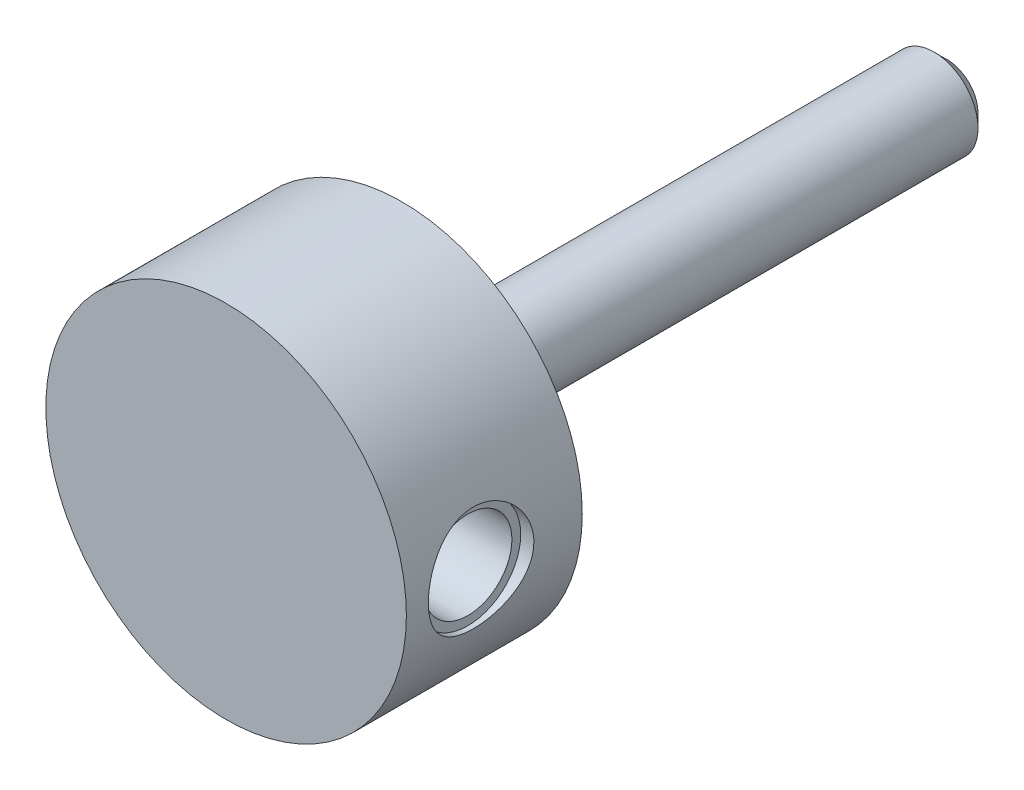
ISO-10303-21;
HEADER;
FILE_DESCRIPTION(('STEP AP214'),'2;1');
FILE_NAME('part.step','',(''),(''),'','','');
FILE_SCHEMA(('AUTOMOTIVE_DESIGN { 1 0 10303 214 1 1 1 1 }'));
ENDSEC;
DATA;
#1=APPLICATION_CONTEXT('core data for automotive mechanical design processes');
#2=APPLICATION_PROTOCOL_DEFINITION('international standard','automotive_design',2000,#1);
#3=PRODUCT_CONTEXT('',#1,'mechanical');
#4=PRODUCT('Part','Part','',(#3));
#5=PRODUCT_RELATED_PRODUCT_CATEGORY('part','',(#4));
#6=PRODUCT_DEFINITION_FORMATION('','',#4);
#7=PRODUCT_DEFINITION_CONTEXT('part definition',#1,'design');
#8=PRODUCT_DEFINITION('design','',#6,#7);
#9=PRODUCT_DEFINITION_SHAPE('','',#8);
#10=(LENGTH_UNIT() NAMED_UNIT(*) SI_UNIT(.MILLI.,.METRE.));
#11=(NAMED_UNIT(*) PLANE_ANGLE_UNIT() SI_UNIT($,.RADIAN.));
#12=(NAMED_UNIT(*) SI_UNIT($,.STERADIAN.) SOLID_ANGLE_UNIT());
#13=UNCERTAINTY_MEASURE_WITH_UNIT(LENGTH_MEASURE(1.E-05),#10,'distance_accuracy_value','');
#14=(GEOMETRIC_REPRESENTATION_CONTEXT(3) GLOBAL_UNCERTAINTY_ASSIGNED_CONTEXT((#13)) GLOBAL_UNIT_ASSIGNED_CONTEXT((#10,
#11,#12)) REPRESENTATION_CONTEXT('',''));
#15=CARTESIAN_POINT('',(0.,0.,0.));
#16=DIRECTION('',(0.,0.,1.));
#17=DIRECTION('',(1.,0.,0.));
#18=AXIS2_PLACEMENT_3D('',#15,#16,#17);
#19=CARTESIAN_POINT('',(0.,0.,0.));
#20=DIRECTION('',(0.,0.,1.));
#21=DIRECTION('',(1.,0.,0.));
#22=AXIS2_PLACEMENT_3D('',#19,#20,#21);
#23=PLANE('',#22);
#24=CARTESIAN_POINT('',(0.,0.,0.));
#25=DIRECTION('',(0.,0.,1.));
#26=DIRECTION('',(1.,0.,0.));
#27=AXIS2_PLACEMENT_3D('',#24,#25,#26);
#28=CIRCLE('',#27,9.5);
#29=CARTESIAN_POINT('',(9.5,0.,0.));
#30=VERTEX_POINT('',#29);
#31=EDGE_CURVE('E27',#30,#30,#28,.T.);
#32=ORIENTED_EDGE('',*,*,#31,.F.);
#33=EDGE_LOOP('',(#32));
#34=FACE_BOUND('',#33,.T.);
#35=CARTESIAN_POINT('',(0.,0.,0.));
#36=DIRECTION('',(0.,0.,1.));
#37=DIRECTION('',(1.,0.,0.));
#38=AXIS2_PLACEMENT_3D('',#35,#36,#37);
#39=CIRCLE('',#38,5.);
#40=CARTESIAN_POINT('',(5.,0.,0.));
#41=VERTEX_POINT('',#40);
#42=EDGE_CURVE('E23',#41,#41,#39,.F.);
#43=ORIENTED_EDGE('',*,*,#42,.F.);
#44=EDGE_LOOP('',(#43));
#45=FACE_BOUND('',#44,.T.);
#46=ADVANCED_FACE('F12',(#34,#45),#23,.F.);
#47=CARTESIAN_POINT('',(0.,0.,40.));
#48=DIRECTION('',(0.,0.,1.));
#49=DIRECTION('',(1.,0.,0.));
#50=AXIS2_PLACEMENT_3D('',#47,#48,#49);
#51=CYLINDRICAL_SURFACE('',#50,9.5);
#52=CARTESIAN_POINT('',(0.,0.,2.));
#53=DIRECTION('',(0.,0.,1.));
#54=DIRECTION('',(1.,0.,0.));
#55=AXIS2_PLACEMENT_3D('',#52,#53,#54);
#56=CIRCLE('',#55,9.5);
#57=CARTESIAN_POINT('',(9.5,0.,2.));
#58=VERTEX_POINT('',#57);
#59=EDGE_CURVE('E38',#58,#58,#56,.T.);
#60=ORIENTED_EDGE('',*,*,#59,.F.);
#61=EDGE_LOOP('',(#60));
#62=FACE_BOUND('',#61,.T.);
#63=ORIENTED_EDGE('',*,*,#31,.T.);
#64=EDGE_LOOP('',(#63));
#65=FACE_BOUND('',#64,.T.);
#66=ADVANCED_FACE('F65',(#62,#65),#51,.T.);
#67=CARTESIAN_POINT('',(20.5,0.,22.));
#68=DIRECTION('',(0.,0.,-1.));
#69=DIRECTION('',(-1.,0.,0.));
#70=AXIS2_PLACEMENT_3D('',#67,#68,#69);
#71=PLANE('',#70);
#72=CARTESIAN_POINT('',(0.,0.,22.));
#73=DIRECTION('',(0.,0.,1.));
#74=DIRECTION('',(1.,0.,0.));
#75=AXIS2_PLACEMENT_3D('',#72,#73,#74);
#76=CIRCLE('',#75,20.5);
#77=CARTESIAN_POINT('',(20.5,0.,22.));
#78=VERTEX_POINT('',#77);
#79=EDGE_CURVE('E82',#78,#78,#76,.T.);
#80=ORIENTED_EDGE('',*,*,#79,.T.);
#81=EDGE_LOOP('',(#80));
#82=FACE_BOUND('',#81,.T.);
#83=ADVANCED_FACE('F60',(#82),#71,.F.);
#84=CARTESIAN_POINT('',(0.,0.,40.));
#85=DIRECTION('',(0.,0.,1.));
#86=DIRECTION('',(1.,0.,0.));
#87=AXIS2_PLACEMENT_3D('',#84,#85,#86);
#88=CYLINDRICAL_SURFACE('',#87,20.5);
#89=CARTESIAN_POINT('',(20.5,0.,7.5));
#90=CARTESIAN_POINT('',(20.4999997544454,-0.164768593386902,7.50000038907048));
#91=CARTESIAN_POINT('',(20.4980087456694,-0.329544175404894,7.50679278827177));
#92=CARTESIAN_POINT('',(20.4900990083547,-0.65788822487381,7.5339021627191));
#93=CARTESIAN_POINT('',(20.4841800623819,-0.821456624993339,7.55421988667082));
#94=CARTESIAN_POINT('',(20.4685766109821,-1.1462122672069,7.60820100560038));
#95=CARTESIAN_POINT('',(20.4588916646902,-1.30739922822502,7.64186596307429));
#96=CARTESIAN_POINT('',(20.4360164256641,-1.62628314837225,7.72226244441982));
#97=CARTESIAN_POINT('',(20.4228249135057,-1.7839788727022,7.76899851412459));
#98=CARTESIAN_POINT('',(20.3933182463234,-2.09448185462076,7.87505403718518));
#99=CARTESIAN_POINT('',(20.3770082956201,-2.24729676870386,7.93435254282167));
#100=CARTESIAN_POINT('',(20.3416823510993,-2.54730770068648,8.06511256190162));
#101=CARTESIAN_POINT('',(20.3226662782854,-2.69450355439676,8.13657443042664));
#102=CARTESIAN_POINT('',(20.2824208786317,-2.98237032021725,8.2911456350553));
#103=CARTESIAN_POINT('',(20.2611910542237,-3.123039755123,8.37425759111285));
#104=CARTESIAN_POINT('',(20.2170775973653,-3.39691169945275,8.55150630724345));
#105=CARTESIAN_POINT('',(20.1941944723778,-3.53011647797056,8.6456396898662));
#106=CARTESIAN_POINT('',(20.146767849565,-3.79154794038,8.84682399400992));
#107=CARTESIAN_POINT('',(20.1221971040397,-3.91956600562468,8.95413966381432));
#108=CARTESIAN_POINT('',(20.0725990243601,-4.1661228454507,9.17897611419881));
#109=CARTESIAN_POINT('',(20.0475718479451,-4.2846648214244,9.29649342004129));
#110=CARTESIAN_POINT('',(19.9977175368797,-4.5116297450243,9.54108035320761));
#111=CARTESIAN_POINT('',(19.9728905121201,-4.62004743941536,9.66815487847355));
#112=CARTESIAN_POINT('',(19.9241410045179,-4.82595045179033,9.93095842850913));
#113=CARTESIAN_POINT('',(19.9002181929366,-4.92343976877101,10.0666842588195));
#114=CARTESIAN_POINT('',(19.8534354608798,-5.10885934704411,10.3490171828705));
#115=CARTESIAN_POINT('',(19.8306098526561,-5.19653638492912,10.4957964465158));
#116=CARTESIAN_POINT('',(19.7872868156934,-5.35913808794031,10.7965125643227));
#117=CARTESIAN_POINT('',(19.766788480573,-5.43406772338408,10.9504465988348));
#118=CARTESIAN_POINT('',(19.7287391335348,-5.57062666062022,11.2645036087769));
#119=CARTESIAN_POINT('',(19.7111887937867,-5.63225293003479,11.4246279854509));
#120=CARTESIAN_POINT('',(19.6796082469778,-5.74162541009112,11.7498143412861));
#121=CARTESIAN_POINT('',(19.6655765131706,-5.78937764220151,11.9148741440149));
#122=CARTESIAN_POINT('',(19.6418018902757,-5.86952471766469,12.2443484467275));
#123=CARTESIAN_POINT('',(19.6319555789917,-5.90229162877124,12.4086649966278));
#124=CARTESIAN_POINT('',(19.6163432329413,-5.95397424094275,12.7395899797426));
#125=CARTESIAN_POINT('',(19.6105755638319,-5.97289549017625,12.9061974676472));
#126=CARTESIAN_POINT('',(19.603301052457,-5.99672775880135,13.2405034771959));
#127=CARTESIAN_POINT('',(19.6017941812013,-6.00163887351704,13.4082019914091));
#128=CARTESIAN_POINT('',(19.6030905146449,-5.99740342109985,13.7434027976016));
#129=CARTESIAN_POINT('',(19.6058936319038,-5.98825713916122,13.9109050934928));
#130=CARTESIAN_POINT('',(19.6155486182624,-5.95655212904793,14.238688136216));
#131=CARTESIAN_POINT('',(19.6222578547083,-5.9344657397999,14.3990190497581));
#132=CARTESIAN_POINT('',(19.6394095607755,-5.87745500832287,14.7172343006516));
#133=CARTESIAN_POINT('',(19.649853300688,-5.84252629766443,14.8751177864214));
#134=CARTESIAN_POINT('',(19.6741615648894,-5.7601395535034,15.187257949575));
#135=CARTESIAN_POINT('',(19.688025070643,-5.71268525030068,15.3415156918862));
#136=CARTESIAN_POINT('',(19.7187796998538,-5.60560692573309,15.6454959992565));
#137=CARTESIAN_POINT('',(19.7356719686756,-5.5459782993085,15.7952168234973));
#138=CARTESIAN_POINT('',(19.7722410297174,-5.41416819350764,16.0910079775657));
#139=CARTESIAN_POINT('',(19.7919506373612,-5.34183608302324,16.2370072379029));
#140=CARTESIAN_POINT('',(19.8334359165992,-5.18568691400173,16.5224423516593));
#141=CARTESIAN_POINT('',(19.8552123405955,-5.10186566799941,16.6618757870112));
#142=CARTESIAN_POINT('',(19.9227548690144,-4.8340177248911,17.0689782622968));
#143=CARTESIAN_POINT('',(19.9707648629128,-4.63350124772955,17.3256854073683));
#144=CARTESIAN_POINT('',(20.0696162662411,-4.18511260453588,17.8126329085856));
#145=CARTESIAN_POINT('',(20.1204944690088,-3.93567819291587,18.0414205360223));
#146=CARTESIAN_POINT('',(20.2176813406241,-3.40132203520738,18.4542852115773));
#147=CARTESIAN_POINT('',(20.2639897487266,-3.11639826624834,18.63835970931));
#148=CARTESIAN_POINT('',(20.3472018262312,-2.51664006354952,18.9573414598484));
#149=CARTESIAN_POINT('',(20.3840462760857,-2.2016334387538,19.0919412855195));
#150=CARTESIAN_POINT('',(20.4437541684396,-1.55212614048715,19.3058343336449));
#151=CARTESIAN_POINT('',(20.4666213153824,-1.21763065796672,19.3851422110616));
#152=CARTESIAN_POINT('',(20.4952175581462,-0.550953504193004,19.4838192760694));
#153=CARTESIAN_POINT('',(20.5015074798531,-0.219085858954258,19.5051506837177));
#154=CARTESIAN_POINT('',(20.4978783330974,0.44350281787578,19.4927506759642));
#155=CARTESIAN_POINT('',(20.4879613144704,0.774223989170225,19.4590262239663));
#156=CARTESIAN_POINT('',(20.4533992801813,1.41781519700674,19.3390673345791));
#157=CARTESIAN_POINT('',(20.4290727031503,1.73091547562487,19.253967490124));
#158=CARTESIAN_POINT('',(20.3684901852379,2.33834273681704,19.0350155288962));
#159=CARTESIAN_POINT('',(20.3322328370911,2.63266749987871,18.901157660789));
#160=CARTESIAN_POINT('',(20.2505580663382,3.201467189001,18.585163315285));
#161=CARTESIAN_POINT('',(20.2049537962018,3.47535043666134,18.4020133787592));
#162=CARTESIAN_POINT('',(20.1098009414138,3.98926947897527,17.9937010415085));
#163=CARTESIAN_POINT('',(20.0602514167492,4.22929716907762,17.7685286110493));
#164=CARTESIAN_POINT('',(19.9860369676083,4.56311282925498,17.3996018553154));
#165=CARTESIAN_POINT('',(19.9608943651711,4.67160496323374,17.2689475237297));
#166=CARTESIAN_POINT('',(19.9116554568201,4.87720494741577,16.9988051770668));
#167=CARTESIAN_POINT('',(19.8875587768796,4.97431688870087,16.8593203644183));
#168=CARTESIAN_POINT('',(19.8411019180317,5.15650338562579,16.5723575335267));
#169=CARTESIAN_POINT('',(19.8187424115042,5.24157329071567,16.4248764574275));
#170=CARTESIAN_POINT('',(19.7764458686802,5.39896546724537,16.1230001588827));
#171=CARTESIAN_POINT('',(19.7565078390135,5.47129297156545,15.9686078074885));
#172=CARTESIAN_POINT('',(19.7197444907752,5.60234699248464,15.6546484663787));
#173=CARTESIAN_POINT('',(19.7029051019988,5.6611353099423,15.49510893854));
#174=CARTESIAN_POINT('',(19.6727610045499,5.76501533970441,15.1713718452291));
#175=CARTESIAN_POINT('',(19.6594548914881,5.81011249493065,15.0071761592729));
#176=CARTESIAN_POINT('',(19.6367999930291,5.88622676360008,14.675294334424));
#177=CARTESIAN_POINT('',(19.6274509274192,5.91724487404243,14.5076084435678));
#178=CARTESIAN_POINT('',(19.6130187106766,5.96490739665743,14.1700260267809));
#179=CARTESIAN_POINT('',(19.6079354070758,5.98155232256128,14.0001295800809));
#180=CARTESIAN_POINT('',(19.6023186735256,5.9999323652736,13.6662567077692));
#181=CARTESIAN_POINT('',(19.6016119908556,6.00223524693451,13.5023141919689));
#182=CARTESIAN_POINT('',(19.6043094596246,5.99341910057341,13.1747666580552));
#183=CARTESIAN_POINT('',(19.6077150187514,5.98229547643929,13.0111617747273));
#184=CARTESIAN_POINT('',(19.6185313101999,5.94672790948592,12.6856110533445));
#185=CARTESIAN_POINT('',(19.6259403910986,5.92228945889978,12.5236645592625));
#186=CARTESIAN_POINT('',(19.6445384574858,5.86030325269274,12.2024601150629));
#187=CARTESIAN_POINT('',(19.6557288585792,5.82275058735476,12.0432031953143));
#188=CARTESIAN_POINT('',(19.6814005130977,5.73537439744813,11.7303823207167));
#189=CARTESIAN_POINT('',(19.6958418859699,5.68569901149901,11.5767736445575));
#190=CARTESIAN_POINT('',(19.7276768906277,5.57423736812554,11.2742707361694));
#191=CARTESIAN_POINT('',(19.7450715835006,5.51244675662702,11.125378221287));
#192=CARTESIAN_POINT('',(19.782319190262,5.37724463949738,10.8333301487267));
#193=CARTESIAN_POINT('',(19.802171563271,5.30383568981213,10.6901733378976));
#194=CARTESIAN_POINT('',(19.8438063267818,5.14587421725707,10.4103722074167));
#195=CARTESIAN_POINT('',(19.8655894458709,5.061317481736,10.2737303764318));
#196=CARTESIAN_POINT('',(19.9112797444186,4.87853600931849,10.0032239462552));
#197=CARTESIAN_POINT('',(19.9352342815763,4.77994030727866,9.86961789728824));
#198=CARTESIAN_POINT('',(19.9839347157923,4.57206196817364,9.61107007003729));
#199=CARTESIAN_POINT('',(20.0086809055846,4.46277534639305,9.48613155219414));
#200=CARTESIAN_POINT('',(20.0582834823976,4.23425660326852,9.24575891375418));
#201=CARTESIAN_POINT('',(20.0831398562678,4.11502564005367,9.13032368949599));
#202=CARTESIAN_POINT('',(20.1323098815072,3.86730499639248,8.90963180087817));
#203=CARTESIAN_POINT('',(20.1566233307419,3.7388119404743,8.80437888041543));
#204=CARTESIAN_POINT('',(20.2046974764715,3.46977987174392,8.6020699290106));
#205=CARTESIAN_POINT('',(20.2284250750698,3.32900807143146,8.50531528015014));
#206=CARTESIAN_POINT('',(20.2739466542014,3.03949915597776,8.32403500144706));
#207=CARTESIAN_POINT('',(20.2957406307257,2.8907620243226,8.23950939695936));
#208=CARTESIAN_POINT('',(20.3367679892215,2.58639447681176,8.0833769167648));
#209=CARTESIAN_POINT('',(20.356002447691,2.43076699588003,8.01176460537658));
#210=CARTESIAN_POINT('',(20.3913677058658,2.11366097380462,7.88201306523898));
#211=CARTESIAN_POINT('',(20.4074988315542,1.95218304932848,7.82387242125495));
#212=CARTESIAN_POINT('',(20.4344672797,1.64423058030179,7.72771145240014));
#213=CARTESIAN_POINT('',(20.4457076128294,1.49828162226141,7.68811373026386));
#214=CARTESIAN_POINT('',(20.4651675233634,1.2036242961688,7.62002138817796));
#215=CARTESIAN_POINT('',(20.4733873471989,1.0549161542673,7.59152586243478));
#216=CARTESIAN_POINT('',(20.4866168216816,0.755624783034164,7.54584620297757));
#217=CARTESIAN_POINT('',(20.491626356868,0.605041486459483,7.52866247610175));
#218=CARTESIAN_POINT('',(20.49831762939,0.302973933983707,7.50574067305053));
#219=CARTESIAN_POINT('',(20.5000002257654,0.151489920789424,7.49999964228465));
#220=CARTESIAN_POINT('',(20.5,0.,7.5));
#221=B_SPLINE_CURVE_WITH_KNOTS('',3,(#89,#90,#91,#92,#93,#94,#95,#96,#97,#98,#99,#100,#101,#102,
#103,#104,#105,#106,#107,#108,#109,#110,#111,#112,#113,#114,#115,#116,#117,#118,#119,#120,#121,
#122,#123,#124,#125,#126,#127,#128,#129,#130,#131,#132,#133,#134,#135,#136,#137,#138,#139,#140,
#141,#142,#143,#144,#145,#146,#147,#148,#149,#150,#151,#152,#153,#154,#155,#156,#157,#158,#159,
#160,#161,#162,#163,#164,#165,#166,#167,#168,#169,#170,#171,#172,#173,#174,#175,#176,#177,#178,
#179,#180,#181,#182,#183,#184,#185,#186,#187,#188,#189,#190,#191,#192,#193,#194,#195,#196,#197,
#198,#199,#200,#201,#202,#203,#204,#205,#206,#207,#208,#209,#210,#211,#212,#213,#214,#215,#216,
#217,#218,#219,#220),.UNSPECIFIED.,.T.,.F.,(4,2,2,2,2,2,2,2,2,2,2,2,2,2,2,2,2,2,2,2,2,2,2,2,2,2,
2,2,2,2,2,2,2,2,2,2,2,2,2,2,2,2,2,2,2,2,2,2,2,2,2,2,2,2,2,2,2,2,2,2,2,2,2,2,2,4),(0.,
0.494166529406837,0.988360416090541,1.48261217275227,1.97703603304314,2.47064184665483,
2.96426207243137,3.45799348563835,3.95157399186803,4.45753270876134,4.96331976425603,
5.46936781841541,5.97523008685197,6.49206535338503,7.00869863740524,7.52544955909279,
8.04197586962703,8.54486934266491,9.04756118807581,9.55024961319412,10.0529278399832,
10.5383093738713,11.0238561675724,11.5092585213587,11.9948448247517,12.4866344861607,
12.9786038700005,13.9617709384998,14.9839152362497,16.006117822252,17.0345689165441,
18.062747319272,19.0556662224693,20.0484595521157,21.0200911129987,21.9918373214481,
22.9853318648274,23.97906383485,24.4935931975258,25.0079370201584,25.5224789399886,
26.0368090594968,26.5487427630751,27.0604726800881,27.5721663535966,28.0838417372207,
28.5751252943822,29.066577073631,29.5578262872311,30.0492596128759,30.5349645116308,
31.0208442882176,31.5066173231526,31.9925744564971,32.4953010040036,32.9982156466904,
33.5010718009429,34.0041121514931,34.5208552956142,35.0375995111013,35.5541256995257,
36.0705976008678,36.525077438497,36.9795201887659,37.4339792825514,37.8883210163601),.UNSPECIFIED.);
#222=CARTESIAN_POINT('',(20.5,0.,7.5));
#223=VERTEX_POINT('',#222);
#224=EDGE_CURVE('E30',#223,#223,#221,.T.);
#225=ORIENTED_EDGE('',*,*,#224,.T.);
#226=EDGE_LOOP('',(#225));
#227=FACE_BOUND('',#226,.T.);
#228=ORIENTED_EDGE('',*,*,#79,.F.);
#229=EDGE_LOOP('',(#228));
#230=FACE_BOUND('',#229,.T.);
#231=CARTESIAN_POINT('',(0.,0.,2.));
#232=DIRECTION('',(0.,0.,1.));
#233=DIRECTION('',(1.,0.,0.));
#234=AXIS2_PLACEMENT_3D('',#231,#232,#233);
#235=CIRCLE('',#234,20.5);
#236=CARTESIAN_POINT('',(20.5,0.,2.));
#237=VERTEX_POINT('',#236);
#238=EDGE_CURVE('E84',#237,#237,#235,.T.);
#239=ORIENTED_EDGE('',*,*,#238,.T.);
#240=EDGE_LOOP('',(#239));
#241=FACE_BOUND('',#240,.T.);
#242=ADVANCED_FACE('F41',(#227,#230,#241),#88,.T.);
#243=CARTESIAN_POINT('',(9.5,0.,2.));
#244=DIRECTION('',(0.,0.,1.));
#245=DIRECTION('',(1.,0.,0.));
#246=AXIS2_PLACEMENT_3D('',#243,#244,#245);
#247=PLANE('',#246);
#248=ORIENTED_EDGE('',*,*,#238,.F.);
#249=EDGE_LOOP('',(#248));
#250=FACE_BOUND('',#249,.T.);
#251=ORIENTED_EDGE('',*,*,#59,.T.);
#252=EDGE_LOOP('',(#251));
#253=FACE_BOUND('',#252,.T.);
#254=ADVANCED_FACE('F49',(#250,#253),#247,.F.);
#255=CARTESIAN_POINT('',(19.,0.,13.5));
#256=DIRECTION('',(1.,0.,0.));
#257=DIRECTION('',(0.,0.,-1.));
#258=AXIS2_PLACEMENT_3D('',#255,#256,#257);
#259=CYLINDRICAL_SURFACE('',#258,6.);
#260=CARTESIAN_POINT('',(19.,0.,13.5));
#261=DIRECTION('',(1.,0.,0.));
#262=DIRECTION('',(0.,0.,-1.));
#263=AXIS2_PLACEMENT_3D('',#260,#261,#262);
#264=CIRCLE('',#263,6.);
#265=CARTESIAN_POINT('',(19.,0.,7.5));
#266=VERTEX_POINT('',#265);
#267=EDGE_CURVE('E39',#266,#266,#264,.T.);
#268=ORIENTED_EDGE('',*,*,#267,.F.);
#269=EDGE_LOOP('',(#268));
#270=FACE_BOUND('',#269,.T.);
#271=ORIENTED_EDGE('',*,*,#224,.F.);
#272=EDGE_LOOP('',(#271));
#273=FACE_BOUND('',#272,.T.);
#274=ADVANCED_FACE('F47',(#270,#273),#259,.F.);
#275=CARTESIAN_POINT('',(19.,0.,13.5));
#276=DIRECTION('',(1.,0.,0.));
#277=DIRECTION('',(0.,0.,-1.));
#278=AXIS2_PLACEMENT_3D('',#275,#276,#277);
#279=PLANE('',#278);
#280=CARTESIAN_POINT('',(19.,0.,13.5));
#281=DIRECTION('',(1.,0.,0.));
#282=DIRECTION('',(0.,0.,-1.));
#283=AXIS2_PLACEMENT_3D('',#280,#281,#282);
#284=CIRCLE('',#283,5.);
#285=CARTESIAN_POINT('',(19.,0.,8.5));
#286=VERTEX_POINT('',#285);
#287=EDGE_CURVE('E96',#286,#286,#284,.T.);
#288=ORIENTED_EDGE('',*,*,#287,.F.);
#289=EDGE_LOOP('',(#288));
#290=FACE_BOUND('',#289,.T.);
#291=ORIENTED_EDGE('',*,*,#267,.T.);
#292=EDGE_LOOP('',(#291));
#293=FACE_BOUND('',#292,.T.);
#294=ADVANCED_FACE('F58',(#290,#293),#279,.T.);
#295=CARTESIAN_POINT('',(10.,0.,13.5));
#296=DIRECTION('',(1.,0.,0.));
#297=DIRECTION('',(0.,0.,-1.));
#298=AXIS2_PLACEMENT_3D('',#295,#296,#297);
#299=CYLINDRICAL_SURFACE('',#298,5.);
#300=CARTESIAN_POINT('',(10.,0.,13.5));
#301=DIRECTION('',(1.,0.,0.));
#302=DIRECTION('',(0.,0.,-1.));
#303=AXIS2_PLACEMENT_3D('',#300,#301,#302);
#304=CIRCLE('',#303,5.);
#305=CARTESIAN_POINT('',(10.,0.,8.5));
#306=VERTEX_POINT('',#305);
#307=EDGE_CURVE('E93',#306,#306,#304,.T.);
#308=ORIENTED_EDGE('',*,*,#307,.F.);
#309=EDGE_LOOP('',(#308));
#310=FACE_BOUND('',#309,.T.);
#311=ORIENTED_EDGE('',*,*,#287,.T.);
#312=EDGE_LOOP('',(#311));
#313=FACE_BOUND('',#312,.T.);
#314=ADVANCED_FACE('F100',(#310,#313),#299,.F.);
#315=CARTESIAN_POINT('',(10.,0.,13.5));
#316=DIRECTION('',(1.,0.,0.));
#317=DIRECTION('',(0.,0.,-1.));
#318=AXIS2_PLACEMENT_3D('',#315,#316,#317);
#319=PLANE('',#318);
#320=ORIENTED_EDGE('',*,*,#307,.T.);
#321=EDGE_LOOP('',(#320));
#322=FACE_BOUND('',#321,.T.);
#323=ADVANCED_FACE('F112',(#322),#319,.T.);
#324=CARTESIAN_POINT('',(0.,0.,-60.));
#325=DIRECTION('',(0.,0.,1.));
#326=DIRECTION('',(1.,0.,0.));
#327=AXIS2_PLACEMENT_3D('',#324,#325,#326);
#328=CYLINDRICAL_SURFACE('',#327,5.);
#329=CARTESIAN_POINT('',(0.,0.,-58.5));
#330=DIRECTION('',(0.,0.,-1.));
#331=DIRECTION('',(-1.,0.,0.));
#332=AXIS2_PLACEMENT_3D('',#329,#330,#331);
#333=CIRCLE('',#332,5.);
#334=CARTESIAN_POINT('',(-5.,0.,-58.5));
#335=VERTEX_POINT('',#334);
#336=EDGE_CURVE('E8',#335,#335,#333,.F.);
#337=ORIENTED_EDGE('',*,*,#336,.T.);
#338=EDGE_LOOP('',(#337));
#339=FACE_BOUND('',#338,.T.);
#340=ORIENTED_EDGE('',*,*,#42,.T.);
#341=EDGE_LOOP('',(#340));
#342=FACE_BOUND('',#341,.T.);
#343=ADVANCED_FACE('F118',(#339,#342),#328,.T.);
#344=CARTESIAN_POINT('',(0.,0.,-60.));
#345=DIRECTION('',(0.,0.,-1.));
#346=DIRECTION('',(-1.,0.,0.));
#347=AXIS2_PLACEMENT_3D('',#344,#345,#346);
#348=PLANE('',#347);
#349=CARTESIAN_POINT('',(0.,0.,-60.));
#350=DIRECTION('',(0.,0.,-1.));
#351=DIRECTION('',(-1.,0.,0.));
#352=AXIS2_PLACEMENT_3D('',#349,#350,#351);
#353=CIRCLE('',#352,3.5);
#354=CARTESIAN_POINT('',(-3.5,0.,-60.));
#355=VERTEX_POINT('',#354);
#356=EDGE_CURVE('E19',#355,#355,#353,.T.);
#357=ORIENTED_EDGE('',*,*,#356,.T.);
#358=EDGE_LOOP('',(#357));
#359=FACE_BOUND('',#358,.T.);
#360=ADVANCED_FACE('F122',(#359),#348,.T.);
#361=CARTESIAN_POINT('',(0.,0.,-60.));
#362=DIRECTION('',(0.,0.,1.));
#363=DIRECTION('',(1.,0.,0.));
#364=AXIS2_PLACEMENT_3D('',#361,#362,#363);
#365=CONICAL_SURFACE('',#364,3.5,0.785398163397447);
#366=ORIENTED_EDGE('',*,*,#336,.F.);
#367=EDGE_LOOP('',(#366));
#368=FACE_BOUND('',#367,.T.);
#369=ORIENTED_EDGE('',*,*,#356,.F.);
#370=EDGE_LOOP('',(#369));
#371=FACE_BOUND('',#370,.T.);
#372=ADVANCED_FACE('F14',(#368,#371),#365,.T.);
#373=CLOSED_SHELL('',(#46,#66,#83,#242,#254,#274,#294,#314,#323,#343,#360,#372));
#374=MANIFOLD_SOLID_BREP('B1',#373);
#375=ADVANCED_BREP_SHAPE_REPRESENTATION('',(#18,#374),#14);
#376=SHAPE_DEFINITION_REPRESENTATION(#9,#375);
ENDSEC;
END-ISO-10303-21;
